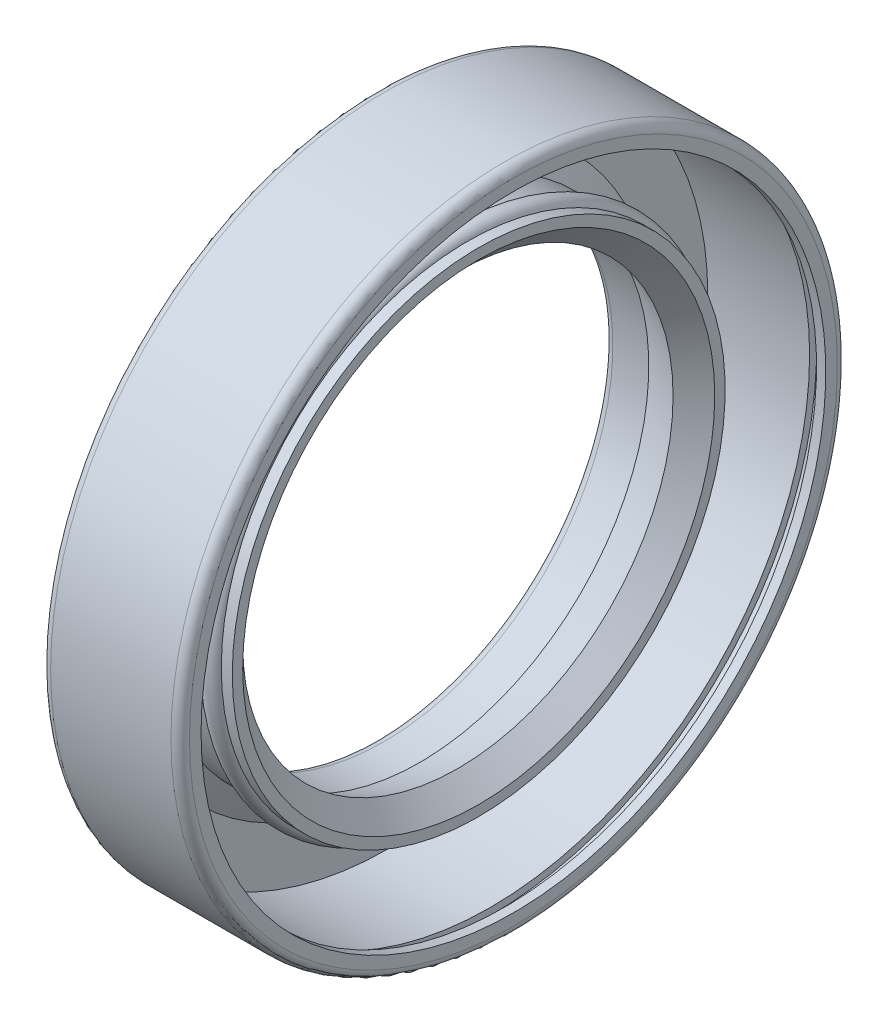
from build123d import *


with BuildPart() as part:
    # Esquisse1 → Base-R_volution (revolve)
    with BuildSketch(Plane(origin=(0, 0, 0), x_dir=(1, 0, 0), z_dir=(0, 1, 0)), mode=Mode.PRIVATE) as base_r_volution_sk:
        with BuildLine():
            Line((0, 9.433012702), (0, 11.666666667))
            ThreePointArc((0, 11.666666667), (0.097631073, 11.902368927), (0.333333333, 12))
            Line((0.333333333, 12), (4.666666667, 12))
            ThreePointArc((4.666666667, 12), (4.902368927, 11.902368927), (5, 11.666666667))
            Line((5, 11.666666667), (5, 11.25))
            Line((5, 11.25), (4.666666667, 11.25))
            Line((4.666666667, 11.25), (4.666666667, 11.75))
            Line((4.666666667, 11.75), (4.166666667, 11.75))
            Line((4.166666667, 11.75), (4.166666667, 11.5))
            Line((4.166666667, 11.5), (0.5, 11.5))
            Line((0.5, 11.5), (0.5, 9.566987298))
            Line((0.5, 9.566987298), (0.971687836, 8.75))
            Line((0.971687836, 8.75), (2.625, 8.75))
            ThreePointArc((2.625, 8.75), (2.936586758, 9.11959946), (3.353553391, 8.875))
            Line((3.353553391, 8.875), (3.75, 8.875))
            Line((3.75, 8.875), (3.75, 8.5))
            Line((3.75, 8.5), (3, 7.75))
            Line((3, 7.75), (1.62626129, 8.25))
            Line((1.62626129, 8.25), (0.333333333, 8.25))
            ThreePointArc((0.333333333, 8.25), (0.097631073, 8.347631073), (0, 8.583333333))
            Line((0, 8.583333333), (0, 9))
            Line((0, 9), (0.25, 9))
            Line((0.25, 9), (0, 9.433012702))
        make_face()
    revolve(base_r_volution_sk.sketch.rotate(Axis((0, 0, 0), (1, 0, 0)), 180), axis=Axis((0, 0, 0), (1, 0, 0)))


solid = part.part
